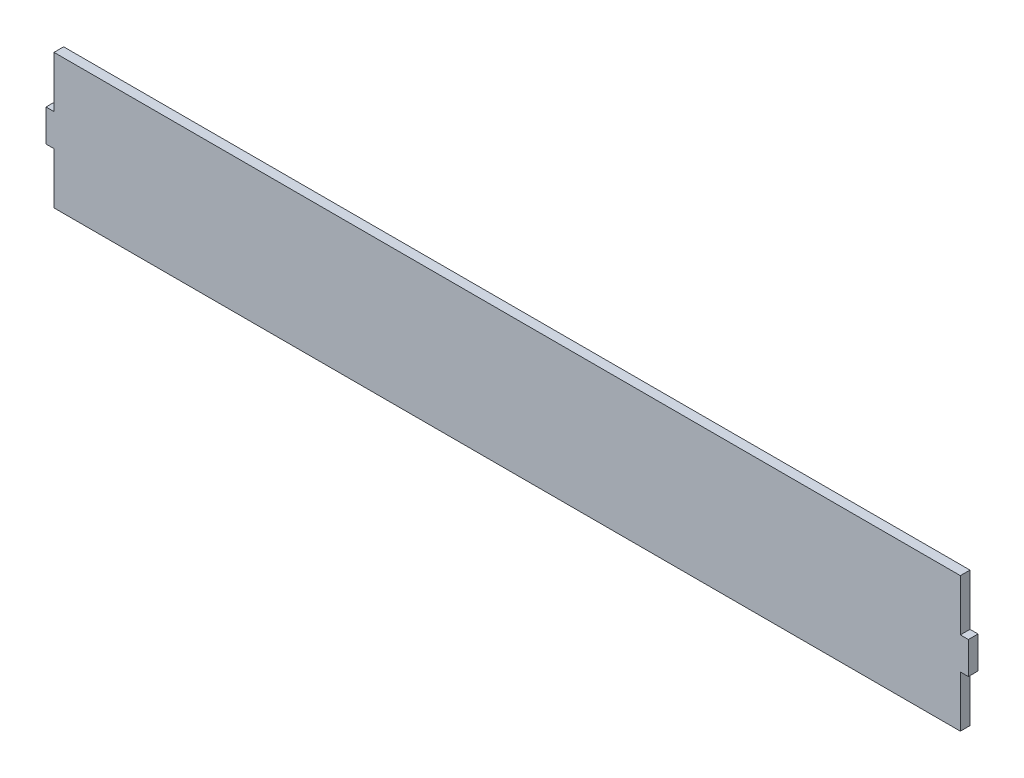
ISO-10303-21;
HEADER;
FILE_DESCRIPTION(('STEP AP214'),'2;1');
FILE_NAME('part.step','',(''),(''),'','','');
FILE_SCHEMA(('AUTOMOTIVE_DESIGN { 1 0 10303 214 1 1 1 1 }'));
ENDSEC;
DATA;
#1=APPLICATION_CONTEXT('core data for automotive mechanical design processes');
#2=APPLICATION_PROTOCOL_DEFINITION('international standard','automotive_design',2000,#1);
#3=PRODUCT_CONTEXT('',#1,'mechanical');
#4=PRODUCT('Part','Part','',(#3));
#5=PRODUCT_RELATED_PRODUCT_CATEGORY('part','',(#4));
#6=PRODUCT_DEFINITION_FORMATION('','',#4);
#7=PRODUCT_DEFINITION_CONTEXT('part definition',#1,'design');
#8=PRODUCT_DEFINITION('design','',#6,#7);
#9=PRODUCT_DEFINITION_SHAPE('','',#8);
#10=(LENGTH_UNIT() NAMED_UNIT(*) SI_UNIT(.MILLI.,.METRE.));
#11=(NAMED_UNIT(*) PLANE_ANGLE_UNIT() SI_UNIT($,.RADIAN.));
#12=(NAMED_UNIT(*) SI_UNIT($,.STERADIAN.) SOLID_ANGLE_UNIT());
#13=UNCERTAINTY_MEASURE_WITH_UNIT(LENGTH_MEASURE(1.E-05),#10,'distance_accuracy_value','');
#14=(GEOMETRIC_REPRESENTATION_CONTEXT(3) GLOBAL_UNCERTAINTY_ASSIGNED_CONTEXT((#13)) GLOBAL_UNIT_ASSIGNED_CONTEXT((#10,
#11,#12)) REPRESENTATION_CONTEXT('',''));
#15=CARTESIAN_POINT('',(0.,0.,0.));
#16=DIRECTION('',(0.,0.,1.));
#17=DIRECTION('',(1.,0.,0.));
#18=AXIS2_PLACEMENT_3D('',#15,#16,#17);
#19=CARTESIAN_POINT('',(-110.233637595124,33.02,3.81));
#20=DIRECTION('',(0.,-1.,0.));
#21=DIRECTION('',(0.,0.,-1.));
#22=AXIS2_PLACEMENT_3D('',#19,#20,#21);
#23=PLANE('',#22);
#24=DIRECTION('',(-1.,0.,0.));
#25=VECTOR('',#24,1.);
#26=CARTESIAN_POINT('',(-110.233637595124,33.02,0.));
#27=LINE('',#26,#25);
#28=CARTESIAN_POINT('',(248.541362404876,33.02,0.));
#29=VERTEX_POINT('',#28);
#30=CARTESIAN_POINT('',(-110.233637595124,33.02,0.));
#31=VERTEX_POINT('',#30);
#32=EDGE_CURVE('E125',#29,#31,#27,.T.);
#33=ORIENTED_EDGE('',*,*,#32,.T.);
#34=DIRECTION('',(0.,0.,-1.));
#35=VECTOR('',#34,1.);
#36=CARTESIAN_POINT('',(-110.233637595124,33.02,3.81));
#37=LINE('',#36,#35);
#38=CARTESIAN_POINT('',(-110.233637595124,33.02,3.81));
#39=VERTEX_POINT('',#38);
#40=EDGE_CURVE('E11',#39,#31,#37,.T.);
#41=ORIENTED_EDGE('',*,*,#40,.F.);
#42=DIRECTION('',(-1.,0.,0.));
#43=VECTOR('',#42,1.);
#44=CARTESIAN_POINT('',(-110.233637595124,33.02,3.81));
#45=LINE('',#44,#43);
#46=CARTESIAN_POINT('',(248.541362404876,33.02,3.81));
#47=VERTEX_POINT('',#46);
#48=EDGE_CURVE('E160',#47,#39,#45,.T.);
#49=ORIENTED_EDGE('',*,*,#48,.F.);
#50=DIRECTION('',(0.,0.,-1.));
#51=VECTOR('',#50,1.);
#52=CARTESIAN_POINT('',(248.541362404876,33.02,3.81));
#53=LINE('',#52,#51);
#54=EDGE_CURVE('E138',#47,#29,#53,.T.);
#55=ORIENTED_EDGE('',*,*,#54,.T.);
#56=EDGE_LOOP('',(#33,#41,#49,#55));
#57=FACE_BOUND('',#56,.T.);
#58=ADVANCED_FACE('F33',(#57),#23,.F.);
#59=CARTESIAN_POINT('',(-110.233637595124,12.7,3.81));
#60=DIRECTION('',(1.,0.,0.));
#61=DIRECTION('',(0.,0.,-1.));
#62=AXIS2_PLACEMENT_3D('',#59,#60,#61);
#63=PLANE('',#62);
#64=DIRECTION('',(0.,-1.,0.));
#65=VECTOR('',#64,1.);
#66=CARTESIAN_POINT('',(-110.233637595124,12.7,0.));
#67=LINE('',#66,#65);
#68=CARTESIAN_POINT('',(-110.233637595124,12.7,0.));
#69=VERTEX_POINT('',#68);
#70=EDGE_CURVE('E121',#31,#69,#67,.T.);
#71=ORIENTED_EDGE('',*,*,#70,.T.);
#72=DIRECTION('',(0.,0.,-1.));
#73=VECTOR('',#72,1.);
#74=CARTESIAN_POINT('',(-110.233637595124,12.7,3.81));
#75=LINE('',#74,#73);
#76=CARTESIAN_POINT('',(-110.233637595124,12.7,3.81));
#77=VERTEX_POINT('',#76);
#78=EDGE_CURVE('E40',#77,#69,#75,.T.);
#79=ORIENTED_EDGE('',*,*,#78,.F.);
#80=DIRECTION('',(0.,-1.,0.));
#81=VECTOR('',#80,1.);
#82=CARTESIAN_POINT('',(-110.233637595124,12.7,3.81));
#83=LINE('',#82,#81);
#84=EDGE_CURVE('E134',#39,#77,#83,.T.);
#85=ORIENTED_EDGE('',*,*,#84,.F.);
#86=ORIENTED_EDGE('',*,*,#40,.T.);
#87=EDGE_LOOP('',(#71,#79,#85,#86));
#88=FACE_BOUND('',#87,.T.);
#89=ADVANCED_FACE('F133',(#88),#63,.F.);
#90=CARTESIAN_POINT('',(-113.408637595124,12.7,3.81));
#91=DIRECTION('',(0.,-1.,0.));
#92=DIRECTION('',(0.,0.,-1.));
#93=AXIS2_PLACEMENT_3D('',#90,#91,#92);
#94=PLANE('',#93);
#95=DIRECTION('',(-1.,0.,0.));
#96=VECTOR('',#95,1.);
#97=CARTESIAN_POINT('',(-113.408637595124,12.7,0.));
#98=LINE('',#97,#96);
#99=CARTESIAN_POINT('',(-113.408637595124,12.7,0.));
#100=VERTEX_POINT('',#99);
#101=EDGE_CURVE('E127',#69,#100,#98,.T.);
#102=ORIENTED_EDGE('',*,*,#101,.T.);
#103=DIRECTION('',(0.,0.,-1.));
#104=VECTOR('',#103,1.);
#105=CARTESIAN_POINT('',(-113.408637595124,12.7,3.81));
#106=LINE('',#105,#104);
#107=CARTESIAN_POINT('',(-113.408637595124,12.7,3.81));
#108=VERTEX_POINT('',#107);
#109=EDGE_CURVE('E206',#108,#100,#106,.T.);
#110=ORIENTED_EDGE('',*,*,#109,.F.);
#111=DIRECTION('',(-1.,0.,0.));
#112=VECTOR('',#111,1.);
#113=CARTESIAN_POINT('',(-113.408637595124,12.7,3.81));
#114=LINE('',#113,#112);
#115=EDGE_CURVE('E163',#77,#108,#114,.T.);
#116=ORIENTED_EDGE('',*,*,#115,.F.);
#117=ORIENTED_EDGE('',*,*,#78,.T.);
#118=EDGE_LOOP('',(#102,#110,#116,#117));
#119=FACE_BOUND('',#118,.T.);
#120=ADVANCED_FACE('F210',(#119),#94,.F.);
#121=CARTESIAN_POINT('',(-113.408637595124,12.7,3.81));
#122=DIRECTION('',(1.,0.,0.));
#123=DIRECTION('',(0.,0.,-1.));
#124=AXIS2_PLACEMENT_3D('',#121,#122,#123);
#125=PLANE('',#124);
#126=DIRECTION('',(0.,-1.,0.));
#127=VECTOR('',#126,1.);
#128=CARTESIAN_POINT('',(-113.408637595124,12.7,0.));
#129=LINE('',#128,#127);
#130=CARTESIAN_POINT('',(-113.408637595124,0.,0.));
#131=VERTEX_POINT('',#130);
#132=EDGE_CURVE('E142',#100,#131,#129,.T.);
#133=ORIENTED_EDGE('',*,*,#132,.T.);
#134=DIRECTION('',(0.,0.,-1.));
#135=VECTOR('',#134,1.);
#136=CARTESIAN_POINT('',(-113.408637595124,0.,3.81));
#137=LINE('',#136,#135);
#138=CARTESIAN_POINT('',(-113.408637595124,0.,3.81));
#139=VERTEX_POINT('',#138);
#140=EDGE_CURVE('E203',#139,#131,#137,.T.);
#141=ORIENTED_EDGE('',*,*,#140,.F.);
#142=DIRECTION('',(0.,-1.,0.));
#143=VECTOR('',#142,1.);
#144=CARTESIAN_POINT('',(-113.408637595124,12.7,3.81));
#145=LINE('',#144,#143);
#146=EDGE_CURVE('E165',#108,#139,#145,.T.);
#147=ORIENTED_EDGE('',*,*,#146,.F.);
#148=ORIENTED_EDGE('',*,*,#109,.T.);
#149=EDGE_LOOP('',(#133,#141,#147,#148));
#150=FACE_BOUND('',#149,.T.);
#151=ADVANCED_FACE('F218',(#150),#125,.F.);
#152=CARTESIAN_POINT('',(-113.408637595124,0.,3.81));
#153=DIRECTION('',(0.,1.,0.));
#154=DIRECTION('',(0.,0.,1.));
#155=AXIS2_PLACEMENT_3D('',#152,#153,#154);
#156=PLANE('',#155);
#157=DIRECTION('',(1.,0.,0.));
#158=VECTOR('',#157,1.);
#159=CARTESIAN_POINT('',(-113.408637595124,0.,0.));
#160=LINE('',#159,#158);
#161=CARTESIAN_POINT('',(-110.233637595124,0.,0.));
#162=VERTEX_POINT('',#161);
#163=EDGE_CURVE('E144',#131,#162,#160,.T.);
#164=ORIENTED_EDGE('',*,*,#163,.T.);
#165=DIRECTION('',(0.,0.,-1.));
#166=VECTOR('',#165,1.);
#167=CARTESIAN_POINT('',(-110.233637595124,0.,3.81));
#168=LINE('',#167,#166);
#169=CARTESIAN_POINT('',(-110.233637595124,0.,3.81));
#170=VERTEX_POINT('',#169);
#171=EDGE_CURVE('E200',#170,#162,#168,.T.);
#172=ORIENTED_EDGE('',*,*,#171,.F.);
#173=DIRECTION('',(1.,0.,0.));
#174=VECTOR('',#173,1.);
#175=CARTESIAN_POINT('',(-113.408637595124,0.,3.81));
#176=LINE('',#175,#174);
#177=EDGE_CURVE('E167',#139,#170,#176,.T.);
#178=ORIENTED_EDGE('',*,*,#177,.F.);
#179=ORIENTED_EDGE('',*,*,#140,.T.);
#180=EDGE_LOOP('',(#164,#172,#178,#179));
#181=FACE_BOUND('',#180,.T.);
#182=ADVANCED_FACE('F221',(#181),#156,.F.);
#183=CARTESIAN_POINT('',(-110.233637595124,0.,3.81));
#184=DIRECTION('',(1.,0.,0.));
#185=DIRECTION('',(0.,0.,-1.));
#186=AXIS2_PLACEMENT_3D('',#183,#184,#185);
#187=PLANE('',#186);
#188=DIRECTION('',(0.,-1.,0.));
#189=VECTOR('',#188,1.);
#190=CARTESIAN_POINT('',(-110.233637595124,0.,0.));
#191=LINE('',#190,#189);
#192=CARTESIAN_POINT('',(-110.233637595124,-20.32,0.));
#193=VERTEX_POINT('',#192);
#194=EDGE_CURVE('E146',#162,#193,#191,.T.);
#195=ORIENTED_EDGE('',*,*,#194,.T.);
#196=DIRECTION('',(0.,0.,-1.));
#197=VECTOR('',#196,1.);
#198=CARTESIAN_POINT('',(-110.233637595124,-20.32,3.81));
#199=LINE('',#198,#197);
#200=CARTESIAN_POINT('',(-110.233637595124,-20.32,3.81));
#201=VERTEX_POINT('',#200);
#202=EDGE_CURVE('E197',#201,#193,#199,.T.);
#203=ORIENTED_EDGE('',*,*,#202,.F.);
#204=DIRECTION('',(0.,-1.,0.));
#205=VECTOR('',#204,1.);
#206=CARTESIAN_POINT('',(-110.233637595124,0.,3.81));
#207=LINE('',#206,#205);
#208=EDGE_CURVE('E169',#170,#201,#207,.T.);
#209=ORIENTED_EDGE('',*,*,#208,.F.);
#210=ORIENTED_EDGE('',*,*,#171,.T.);
#211=EDGE_LOOP('',(#195,#203,#209,#210));
#212=FACE_BOUND('',#211,.T.);
#213=ADVANCED_FACE('F226',(#212),#187,.F.);
#214=CARTESIAN_POINT('',(-110.233637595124,-20.32,3.81));
#215=DIRECTION('',(0.,1.,0.));
#216=DIRECTION('',(-1.,0.,0.));
#217=AXIS2_PLACEMENT_3D('',#214,#215,#216);
#218=PLANE('',#217);
#219=DIRECTION('',(1.,0.,0.));
#220=VECTOR('',#219,1.);
#221=CARTESIAN_POINT('',(-110.233637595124,-20.32,0.));
#222=LINE('',#221,#220);
#223=CARTESIAN_POINT('',(248.541362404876,-20.32,0.));
#224=VERTEX_POINT('',#223);
#225=EDGE_CURVE('E148',#193,#224,#222,.T.);
#226=ORIENTED_EDGE('',*,*,#225,.T.);
#227=DIRECTION('',(0.,0.,-1.));
#228=VECTOR('',#227,1.);
#229=CARTESIAN_POINT('',(248.541362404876,-20.32,3.81));
#230=LINE('',#229,#228);
#231=CARTESIAN_POINT('',(248.541362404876,-20.32,3.81));
#232=VERTEX_POINT('',#231);
#233=EDGE_CURVE('E194',#232,#224,#230,.T.);
#234=ORIENTED_EDGE('',*,*,#233,.F.);
#235=DIRECTION('',(1.,0.,0.));
#236=VECTOR('',#235,1.);
#237=CARTESIAN_POINT('',(-110.233637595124,-20.32,3.81));
#238=LINE('',#237,#236);
#239=EDGE_CURVE('E171',#201,#232,#238,.T.);
#240=ORIENTED_EDGE('',*,*,#239,.F.);
#241=ORIENTED_EDGE('',*,*,#202,.T.);
#242=EDGE_LOOP('',(#226,#234,#240,#241));
#243=FACE_BOUND('',#242,.T.);
#244=ADVANCED_FACE('F232',(#243),#218,.F.);
#245=CARTESIAN_POINT('',(248.541362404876,0.,3.81));
#246=DIRECTION('',(-1.,0.,0.));
#247=DIRECTION('',(0.,0.,1.));
#248=AXIS2_PLACEMENT_3D('',#245,#246,#247);
#249=PLANE('',#248);
#250=DIRECTION('',(0.,1.,0.));
#251=VECTOR('',#250,1.);
#252=CARTESIAN_POINT('',(248.541362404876,0.,0.));
#253=LINE('',#252,#251);
#254=CARTESIAN_POINT('',(248.541362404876,0.,0.));
#255=VERTEX_POINT('',#254);
#256=EDGE_CURVE('E150',#224,#255,#253,.T.);
#257=ORIENTED_EDGE('',*,*,#256,.T.);
#258=DIRECTION('',(0.,0.,-1.));
#259=VECTOR('',#258,1.);
#260=CARTESIAN_POINT('',(248.541362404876,0.,3.81));
#261=LINE('',#260,#259);
#262=CARTESIAN_POINT('',(248.541362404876,0.,3.81));
#263=VERTEX_POINT('',#262);
#264=EDGE_CURVE('E191',#263,#255,#261,.T.);
#265=ORIENTED_EDGE('',*,*,#264,.F.);
#266=DIRECTION('',(0.,1.,0.));
#267=VECTOR('',#266,1.);
#268=CARTESIAN_POINT('',(248.541362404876,0.,3.81));
#269=LINE('',#268,#267);
#270=EDGE_CURVE('E173',#232,#263,#269,.T.);
#271=ORIENTED_EDGE('',*,*,#270,.F.);
#272=ORIENTED_EDGE('',*,*,#233,.T.);
#273=EDGE_LOOP('',(#257,#265,#271,#272));
#274=FACE_BOUND('',#273,.T.);
#275=ADVANCED_FACE('F236',(#274),#249,.F.);
#276=CARTESIAN_POINT('',(248.541362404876,0.,3.81));
#277=DIRECTION('',(0.,1.,0.));
#278=DIRECTION('',(-1.,0.,0.));
#279=AXIS2_PLACEMENT_3D('',#276,#277,#278);
#280=PLANE('',#279);
#281=DIRECTION('',(1.,0.,0.));
#282=VECTOR('',#281,1.);
#283=CARTESIAN_POINT('',(248.541362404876,0.,0.));
#284=LINE('',#283,#282);
#285=CARTESIAN_POINT('',(251.716362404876,0.,0.));
#286=VERTEX_POINT('',#285);
#287=EDGE_CURVE('E152',#255,#286,#284,.T.);
#288=ORIENTED_EDGE('',*,*,#287,.T.);
#289=DIRECTION('',(0.,0.,-1.));
#290=VECTOR('',#289,1.);
#291=CARTESIAN_POINT('',(251.716362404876,0.,3.81));
#292=LINE('',#291,#290);
#293=CARTESIAN_POINT('',(251.716362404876,0.,3.81));
#294=VERTEX_POINT('',#293);
#295=EDGE_CURVE('E188',#294,#286,#292,.T.);
#296=ORIENTED_EDGE('',*,*,#295,.F.);
#297=DIRECTION('',(1.,0.,0.));
#298=VECTOR('',#297,1.);
#299=CARTESIAN_POINT('',(248.541362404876,0.,3.81));
#300=LINE('',#299,#298);
#301=EDGE_CURVE('E175',#263,#294,#300,.T.);
#302=ORIENTED_EDGE('',*,*,#301,.F.);
#303=ORIENTED_EDGE('',*,*,#264,.T.);
#304=EDGE_LOOP('',(#288,#296,#302,#303));
#305=FACE_BOUND('',#304,.T.);
#306=ADVANCED_FACE('F241',(#305),#280,.F.);
#307=CARTESIAN_POINT('',(251.716362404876,12.7,3.81));
#308=DIRECTION('',(-1.,0.,0.));
#309=DIRECTION('',(0.,0.,1.));
#310=AXIS2_PLACEMENT_3D('',#307,#308,#309);
#311=PLANE('',#310);
#312=DIRECTION('',(0.,1.,0.));
#313=VECTOR('',#312,1.);
#314=CARTESIAN_POINT('',(251.716362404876,12.7,0.));
#315=LINE('',#314,#313);
#316=CARTESIAN_POINT('',(251.716362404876,12.7,0.));
#317=VERTEX_POINT('',#316);
#318=EDGE_CURVE('E154',#286,#317,#315,.T.);
#319=ORIENTED_EDGE('',*,*,#318,.T.);
#320=DIRECTION('',(0.,0.,-1.));
#321=VECTOR('',#320,1.);
#322=CARTESIAN_POINT('',(251.716362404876,12.7,3.81));
#323=LINE('',#322,#321);
#324=CARTESIAN_POINT('',(251.716362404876,12.7,3.81));
#325=VERTEX_POINT('',#324);
#326=EDGE_CURVE('E185',#325,#317,#323,.T.);
#327=ORIENTED_EDGE('',*,*,#326,.F.);
#328=DIRECTION('',(0.,1.,0.));
#329=VECTOR('',#328,1.);
#330=CARTESIAN_POINT('',(251.716362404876,12.7,3.81));
#331=LINE('',#330,#329);
#332=EDGE_CURVE('E177',#294,#325,#331,.T.);
#333=ORIENTED_EDGE('',*,*,#332,.F.);
#334=ORIENTED_EDGE('',*,*,#295,.T.);
#335=EDGE_LOOP('',(#319,#327,#333,#334));
#336=FACE_BOUND('',#335,.T.);
#337=ADVANCED_FACE('F245',(#336),#311,.F.);
#338=CARTESIAN_POINT('',(248.541362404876,12.7,3.81));
#339=DIRECTION('',(0.,-1.,0.));
#340=DIRECTION('',(0.,0.,-1.));
#341=AXIS2_PLACEMENT_3D('',#338,#339,#340);
#342=PLANE('',#341);
#343=DIRECTION('',(-1.,0.,0.));
#344=VECTOR('',#343,1.);
#345=CARTESIAN_POINT('',(248.541362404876,12.7,0.));
#346=LINE('',#345,#344);
#347=CARTESIAN_POINT('',(248.541362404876,12.7,0.));
#348=VERTEX_POINT('',#347);
#349=EDGE_CURVE('E156',#317,#348,#346,.T.);
#350=ORIENTED_EDGE('',*,*,#349,.T.);
#351=DIRECTION('',(0.,0.,-1.));
#352=VECTOR('',#351,1.);
#353=CARTESIAN_POINT('',(248.541362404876,12.7,3.81));
#354=LINE('',#353,#352);
#355=CARTESIAN_POINT('',(248.541362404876,12.7,3.81));
#356=VERTEX_POINT('',#355);
#357=EDGE_CURVE('E182',#356,#348,#354,.T.);
#358=ORIENTED_EDGE('',*,*,#357,.F.);
#359=DIRECTION('',(-1.,0.,0.));
#360=VECTOR('',#359,1.);
#361=CARTESIAN_POINT('',(248.541362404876,12.7,3.81));
#362=LINE('',#361,#360);
#363=EDGE_CURVE('E52',#325,#356,#362,.T.);
#364=ORIENTED_EDGE('',*,*,#363,.F.);
#365=ORIENTED_EDGE('',*,*,#326,.T.);
#366=EDGE_LOOP('',(#350,#358,#364,#365));
#367=FACE_BOUND('',#366,.T.);
#368=ADVANCED_FACE('F249',(#367),#342,.F.);
#369=CARTESIAN_POINT('',(248.541362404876,12.7,3.81));
#370=DIRECTION('',(-1.,0.,0.));
#371=DIRECTION('',(0.,0.,1.));
#372=AXIS2_PLACEMENT_3D('',#369,#370,#371);
#373=PLANE('',#372);
#374=DIRECTION('',(0.,1.,0.));
#375=VECTOR('',#374,1.);
#376=CARTESIAN_POINT('',(248.541362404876,12.7,0.));
#377=LINE('',#376,#375);
#378=EDGE_CURVE('E158',#348,#29,#377,.T.);
#379=ORIENTED_EDGE('',*,*,#378,.T.);
#380=ORIENTED_EDGE('',*,*,#54,.F.);
#381=DIRECTION('',(0.,1.,0.));
#382=VECTOR('',#381,1.);
#383=CARTESIAN_POINT('',(248.541362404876,12.7,3.81));
#384=LINE('',#383,#382);
#385=EDGE_CURVE('E47',#356,#47,#384,.T.);
#386=ORIENTED_EDGE('',*,*,#385,.F.);
#387=ORIENTED_EDGE('',*,*,#357,.T.);
#388=EDGE_LOOP('',(#379,#380,#386,#387));
#389=FACE_BOUND('',#388,.T.);
#390=ADVANCED_FACE('F251',(#389),#373,.F.);
#391=CARTESIAN_POINT('',(248.541362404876,33.02,3.81));
#392=DIRECTION('',(0.,0.,1.));
#393=DIRECTION('',(1.,0.,0.));
#394=AXIS2_PLACEMENT_3D('',#391,#392,#393);
#395=PLANE('',#394);
#396=ORIENTED_EDGE('',*,*,#48,.T.);
#397=ORIENTED_EDGE('',*,*,#84,.T.);
#398=ORIENTED_EDGE('',*,*,#115,.T.);
#399=ORIENTED_EDGE('',*,*,#146,.T.);
#400=ORIENTED_EDGE('',*,*,#177,.T.);
#401=ORIENTED_EDGE('',*,*,#208,.T.);
#402=ORIENTED_EDGE('',*,*,#239,.T.);
#403=ORIENTED_EDGE('',*,*,#270,.T.);
#404=ORIENTED_EDGE('',*,*,#301,.T.);
#405=ORIENTED_EDGE('',*,*,#332,.T.);
#406=ORIENTED_EDGE('',*,*,#363,.T.);
#407=ORIENTED_EDGE('',*,*,#385,.T.);
#408=EDGE_LOOP('',(#396,#397,#398,#399,#400,#401,#402,#403,#404,#405,#406,#407));
#409=FACE_BOUND('',#408,.T.);
#410=ADVANCED_FACE('F213',(#409),#395,.T.);
#411=CARTESIAN_POINT('',(248.541362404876,33.02,0.));
#412=DIRECTION('',(0.,0.,1.));
#413=DIRECTION('',(1.,0.,0.));
#414=AXIS2_PLACEMENT_3D('',#411,#412,#413);
#415=PLANE('',#414);
#416=ORIENTED_EDGE('',*,*,#32,.F.);
#417=ORIENTED_EDGE('',*,*,#378,.F.);
#418=ORIENTED_EDGE('',*,*,#349,.F.);
#419=ORIENTED_EDGE('',*,*,#318,.F.);
#420=ORIENTED_EDGE('',*,*,#287,.F.);
#421=ORIENTED_EDGE('',*,*,#256,.F.);
#422=ORIENTED_EDGE('',*,*,#225,.F.);
#423=ORIENTED_EDGE('',*,*,#194,.F.);
#424=ORIENTED_EDGE('',*,*,#163,.F.);
#425=ORIENTED_EDGE('',*,*,#132,.F.);
#426=ORIENTED_EDGE('',*,*,#101,.F.);
#427=ORIENTED_EDGE('',*,*,#70,.F.);
#428=EDGE_LOOP('',(#416,#417,#418,#419,#420,#421,#422,#423,#424,#425,#426,#427));
#429=FACE_BOUND('',#428,.T.);
#430=ADVANCED_FACE('F122',(#429),#415,.F.);
#431=CLOSED_SHELL('',(#58,#89,#120,#151,#182,#213,#244,#275,#306,#337,#368,#390,#410,#430));
#432=MANIFOLD_SOLID_BREP('B2',#431);
#433=ADVANCED_BREP_SHAPE_REPRESENTATION('',(#18,#432),#14);
#434=SHAPE_DEFINITION_REPRESENTATION(#9,#433);
ENDSEC;
END-ISO-10303-21;
